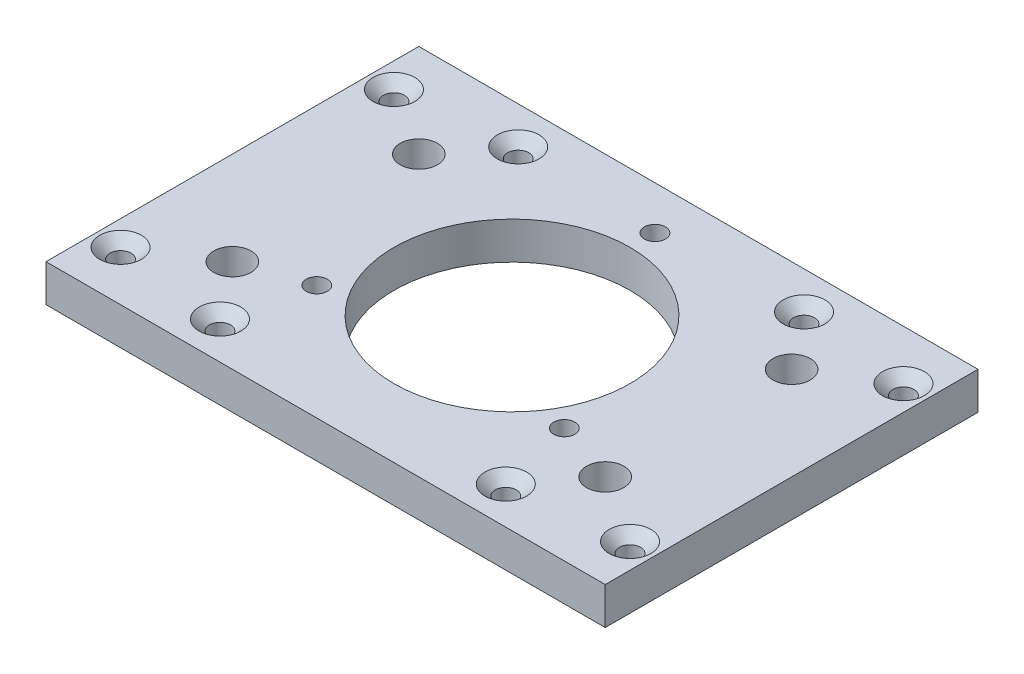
from build123d import *

# Parameters (mm, degrees)
SKETCH1_W                     = 60
SKETCH1_H                     = 6
BOSS_EXTRUDE1_DEPTH           = 45
SKETCH2_R                     = 19
CUT_EXTRUDE1_DEPTH            = 55.415071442
CSK_FOR_M3_SFHCS3_D           = 3.4
CSK_FOR_M3_SFHCS3_CSINK_D     = 6.72
CSK_FOR_M3_SFHCS3_CSINK_ANGLE = 90
CSK_FOR_M3_SFHCS2_D           = 3.4
CSK_FOR_M3_SFHCS2_CSINK_D     = 6.72
CSK_FOR_M3_SFHCS2_CSINK_ANGLE = 90
CSK_FOR_M3_SFHCS1_D           = 3.4
CSK_FOR_M3_SFHCS1_CSINK_D     = 6.72
CSK_FOR_M3_SFHCS1_CSINK_ANGLE = 90
F_6_0_6_DIAMETER_HOLE1_D      = 6


with BuildPart() as part:
    # Sketch1 → Boss-Extrude1 (new, symmetric)
    with BuildSketch(Plane(origin=(0, 0, 0), x_dir=(0, 0, -1), z_dir=(1, 0, 0))):
        Rectangle(SKETCH1_W, SKETCH1_H)
    extrude(amount=BOSS_EXTRUDE1_DEPTH, both=True)

    # Sketch2 → Cut-Extrude1 (cut, through all)
    with BuildSketch(Plane(origin=(0, 3, 0), x_dir=(1, 0, 0), z_dir=(0, 1, 0))):
        with Locations(Location((0, 0, 0), (0, 0, 270))):
            Circle(SKETCH2_R)
    extrude(amount=-CUT_EXTRUDE1_DEPTH, mode=Mode.SUBTRACT)

    # CSK for M3 SFHCS3 (through all)
    with Locations(Plane(origin=(0, 3, 0), x_dir=(1, 0, 0), z_dir=(0, 1, 0))):
        with Locations((-23, 24), (23, 24), (23, -24), (-23, -24)):
            CounterSinkHole(CSK_FOR_M3_SFHCS3_D / 2, CSK_FOR_M3_SFHCS3_CSINK_D / 2, counter_sink_angle=CSK_FOR_M3_SFHCS3_CSINK_ANGLE)

    # CSK for M3 SFHCS2 (through all)
    with Locations(Plane(origin=(0, 3, 0), x_dir=(1, 0, 0), z_dir=(0, 1, 0))):
        with Locations((-41, 22), (41, 22), (41, -22), (-41, -22)):
            CounterSinkHole(CSK_FOR_M3_SFHCS2_D / 2, CSK_FOR_M3_SFHCS2_CSINK_D / 2, counter_sink_angle=CSK_FOR_M3_SFHCS2_CSINK_ANGLE)

    # CSK for M3 SFHCS1 (through all)
    with Locations(Plane(origin=(0, -3, 0), x_dir=(-1, 0, 0), z_dir=(0, -1, 0))):
        with Locations((19.918584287, -11.5), (-19.918584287, -11.5), (0, 23)):
            CounterSinkHole(CSK_FOR_M3_SFHCS1_D / 2, CSK_FOR_M3_SFHCS1_CSINK_D / 2, counter_sink_angle=CSK_FOR_M3_SFHCS1_CSINK_ANGLE)

    # 6.0 _6_ Diameter Hole1 (through all)
    with Locations(Plane(origin=(0, 3, 0), x_dir=(1, 0, 0), z_dir=(0, 1, 0))):
        with Locations((-30, 15), (-30, -15), (30, -15), (30, 15)):
            Hole(F_6_0_6_DIAMETER_HOLE1_D / 2)


solid = part.part
